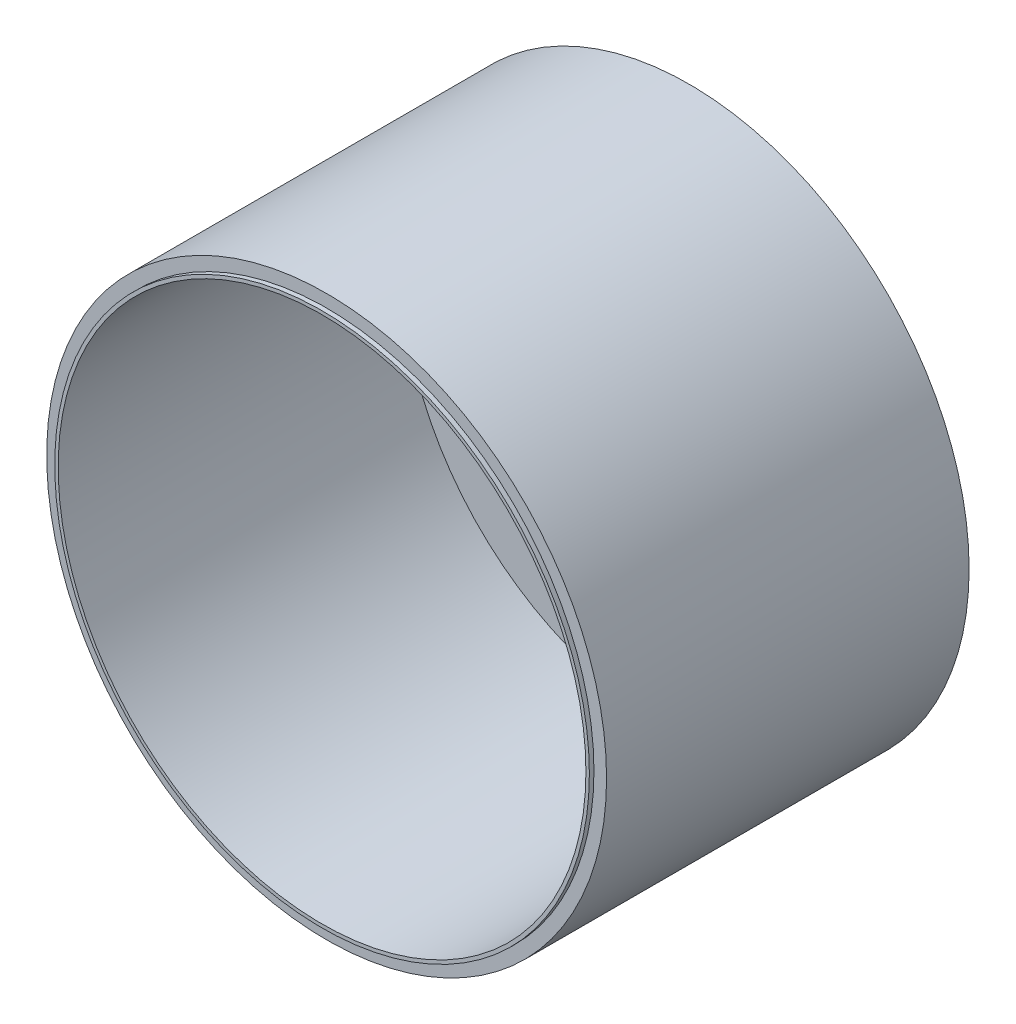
ISO-10303-21;
HEADER;
FILE_DESCRIPTION(('STEP AP214'),'2;1');
FILE_NAME('part.step','',(''),(''),'','','');
FILE_SCHEMA(('AUTOMOTIVE_DESIGN { 1 0 10303 214 1 1 1 1 }'));
ENDSEC;
DATA;
#1=APPLICATION_CONTEXT('core data for automotive mechanical design processes');
#2=APPLICATION_PROTOCOL_DEFINITION('international standard','automotive_design',2000,#1);
#3=PRODUCT_CONTEXT('',#1,'mechanical');
#4=PRODUCT('Part','Part','',(#3));
#5=PRODUCT_RELATED_PRODUCT_CATEGORY('part','',(#4));
#6=PRODUCT_DEFINITION_FORMATION('','',#4);
#7=PRODUCT_DEFINITION_CONTEXT('part definition',#1,'design');
#8=PRODUCT_DEFINITION('design','',#6,#7);
#9=PRODUCT_DEFINITION_SHAPE('','',#8);
#10=(LENGTH_UNIT() NAMED_UNIT(*) SI_UNIT(.MILLI.,.METRE.));
#11=(NAMED_UNIT(*) PLANE_ANGLE_UNIT() SI_UNIT($,.RADIAN.));
#12=(NAMED_UNIT(*) SI_UNIT($,.STERADIAN.) SOLID_ANGLE_UNIT());
#13=UNCERTAINTY_MEASURE_WITH_UNIT(LENGTH_MEASURE(1.E-05),#10,'distance_accuracy_value','');
#14=(GEOMETRIC_REPRESENTATION_CONTEXT(3) GLOBAL_UNCERTAINTY_ASSIGNED_CONTEXT((#13)) GLOBAL_UNIT_ASSIGNED_CONTEXT((#10,
#11,#12)) REPRESENTATION_CONTEXT('',''));
#15=CARTESIAN_POINT('',(0.,0.,0.));
#16=DIRECTION('',(0.,0.,1.));
#17=DIRECTION('',(1.,0.,0.));
#18=AXIS2_PLACEMENT_3D('',#15,#16,#17);
#19=CARTESIAN_POINT('',(0.,0.,16.));
#20=DIRECTION('',(0.,0.,1.));
#21=DIRECTION('',(1.,0.,0.));
#22=AXIS2_PLACEMENT_3D('',#19,#20,#21);
#23=PLANE('',#22);
#24=CARTESIAN_POINT('',(0.,0.,16.));
#25=DIRECTION('',(0.,0.,1.));
#26=DIRECTION('',(1.,0.,0.));
#27=AXIS2_PLACEMENT_3D('',#24,#25,#26);
#28=CIRCLE('',#27,11.5);
#29=CARTESIAN_POINT('',(11.5,0.,16.));
#30=VERTEX_POINT('',#29);
#31=EDGE_CURVE('E48',#30,#30,#28,.T.);
#32=ORIENTED_EDGE('',*,*,#31,.F.);
#33=EDGE_LOOP('',(#32));
#34=FACE_BOUND('',#33,.T.);
#35=CARTESIAN_POINT('',(0.,0.,16.));
#36=DIRECTION('',(0.,0.,1.));
#37=DIRECTION('',(1.,0.,0.));
#38=AXIS2_PLACEMENT_3D('',#35,#36,#37);
#39=CIRCLE('',#38,11.65);
#40=CARTESIAN_POINT('',(11.65,0.,16.));
#41=VERTEX_POINT('',#40);
#42=EDGE_CURVE('E58',#41,#41,#39,.T.);
#43=ORIENTED_EDGE('',*,*,#42,.T.);
#44=EDGE_LOOP('',(#43));
#45=FACE_BOUND('',#44,.T.);
#46=ADVANCED_FACE('F37',(#34,#45),#23,.T.);
#47=CARTESIAN_POINT('',(0.,0.,1.));
#48=DIRECTION('',(0.,0.,1.));
#49=DIRECTION('',(1.,0.,0.));
#50=AXIS2_PLACEMENT_3D('',#47,#48,#49);
#51=CYLINDRICAL_SURFACE('',#50,11.5);
#52=CARTESIAN_POINT('',(0.,0.,1.));
#53=DIRECTION('',(0.,0.,1.));
#54=DIRECTION('',(1.,0.,0.));
#55=AXIS2_PLACEMENT_3D('',#52,#53,#54);
#56=CIRCLE('',#55,11.5);
#57=CARTESIAN_POINT('',(11.5,0.,1.));
#58=VERTEX_POINT('',#57);
#59=EDGE_CURVE('E44',#58,#58,#56,.T.);
#60=ORIENTED_EDGE('',*,*,#59,.F.);
#61=EDGE_LOOP('',(#60));
#62=FACE_BOUND('',#61,.T.);
#63=ORIENTED_EDGE('',*,*,#31,.T.);
#64=EDGE_LOOP('',(#63));
#65=FACE_BOUND('',#64,.T.);
#66=ADVANCED_FACE('F81',(#62,#65),#51,.F.);
#67=CARTESIAN_POINT('',(0.,0.,1.));
#68=DIRECTION('',(0.,0.,1.));
#69=DIRECTION('',(1.,0.,0.));
#70=AXIS2_PLACEMENT_3D('',#67,#68,#69);
#71=PLANE('',#70);
#72=ORIENTED_EDGE('',*,*,#59,.T.);
#73=EDGE_LOOP('',(#72));
#74=FACE_BOUND('',#73,.T.);
#75=ADVANCED_FACE('F70',(#74),#71,.T.);
#76=CARTESIAN_POINT('',(0.,0.,15.8));
#77=DIRECTION('',(0.,0.,1.));
#78=DIRECTION('',(1.,0.,0.));
#79=AXIS2_PLACEMENT_3D('',#76,#77,#78);
#80=PLANE('',#79);
#81=CARTESIAN_POINT('',(0.,0.,15.8));
#82=DIRECTION('',(0.,0.,1.));
#83=DIRECTION('',(1.,0.,0.));
#84=AXIS2_PLACEMENT_3D('',#81,#82,#83);
#85=CIRCLE('',#84,11.65);
#86=CARTESIAN_POINT('',(11.65,0.,15.8));
#87=VERTEX_POINT('',#86);
#88=EDGE_CURVE('E57',#87,#87,#85,.T.);
#89=ORIENTED_EDGE('',*,*,#88,.F.);
#90=EDGE_LOOP('',(#89));
#91=FACE_BOUND('',#90,.T.);
#92=CARTESIAN_POINT('',(0.,0.,15.8));
#93=DIRECTION('',(0.,0.,1.));
#94=DIRECTION('',(1.,0.,0.));
#95=AXIS2_PLACEMENT_3D('',#92,#93,#94);
#96=CIRCLE('',#95,12.2);
#97=CARTESIAN_POINT('',(12.2,0.,15.8));
#98=VERTEX_POINT('',#97);
#99=EDGE_CURVE('E53',#98,#98,#96,.T.);
#100=ORIENTED_EDGE('',*,*,#99,.T.);
#101=EDGE_LOOP('',(#100));
#102=FACE_BOUND('',#101,.T.);
#103=ADVANCED_FACE('F67',(#91,#102),#80,.T.);
#104=CARTESIAN_POINT('',(0.,0.,15.8));
#105=DIRECTION('',(0.,0.,1.));
#106=DIRECTION('',(1.,0.,0.));
#107=AXIS2_PLACEMENT_3D('',#104,#105,#106);
#108=CYLINDRICAL_SURFACE('',#107,11.65);
#109=ORIENTED_EDGE('',*,*,#88,.T.);
#110=EDGE_LOOP('',(#109));
#111=FACE_BOUND('',#110,.T.);
#112=ORIENTED_EDGE('',*,*,#42,.F.);
#113=EDGE_LOOP('',(#112));
#114=FACE_BOUND('',#113,.T.);
#115=ADVANCED_FACE('F64',(#111,#114),#108,.T.);
#116=CARTESIAN_POINT('',(0.,0.,0.));
#117=DIRECTION('',(0.,0.,1.));
#118=DIRECTION('',(1.,0.,0.));
#119=AXIS2_PLACEMENT_3D('',#116,#117,#118);
#120=PLANE('',#119);
#121=CARTESIAN_POINT('',(0.,0.,0.));
#122=DIRECTION('',(0.,0.,1.));
#123=DIRECTION('',(1.,0.,0.));
#124=AXIS2_PLACEMENT_3D('',#121,#122,#123);
#125=CIRCLE('',#124,12.2);
#126=CARTESIAN_POINT('',(12.2,0.,0.));
#127=VERTEX_POINT('',#126);
#128=EDGE_CURVE('E10',#127,#127,#125,.T.);
#129=ORIENTED_EDGE('',*,*,#128,.F.);
#130=EDGE_LOOP('',(#129));
#131=FACE_BOUND('',#130,.T.);
#132=ADVANCED_FACE('F75',(#131),#120,.F.);
#133=CARTESIAN_POINT('',(0.,0.,16.));
#134=DIRECTION('',(0.,0.,-1.));
#135=DIRECTION('',(-1.,0.,0.));
#136=AXIS2_PLACEMENT_3D('',#133,#134,#135);
#137=CYLINDRICAL_SURFACE('',#136,12.2);
#138=ORIENTED_EDGE('',*,*,#128,.T.);
#139=EDGE_LOOP('',(#138));
#140=FACE_BOUND('',#139,.T.);
#141=ORIENTED_EDGE('',*,*,#99,.F.);
#142=EDGE_LOOP('',(#141));
#143=FACE_BOUND('',#142,.T.);
#144=ADVANCED_FACE('F39',(#140,#143),#137,.T.);
#145=CLOSED_SHELL('',(#46,#66,#75,#103,#115,#132,#144));
#146=MANIFOLD_SOLID_BREP('B2',#145);
#147=ADVANCED_BREP_SHAPE_REPRESENTATION('',(#18,#146),#14);
#148=SHAPE_DEFINITION_REPRESENTATION(#9,#147);
ENDSEC;
END-ISO-10303-21;
